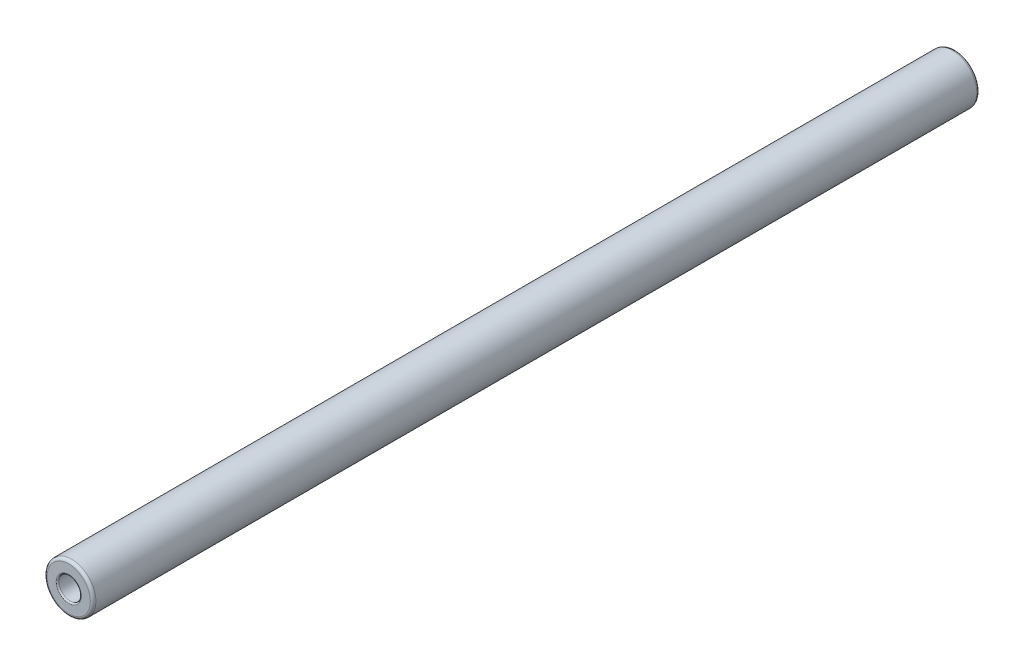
from build123d import *

# Parameters (mm, degrees)
SCHIZZO1_R               = 17.5
RACCORDO1_R              = 2
SCHIZZO5_R               = 8
TAGLIO_ESTRUSIONE3_DEPTH = 75
TAGLIO_ESTRUSIONE4_START = -75
SCHIZZO6_R               = 8
TAGLIO_ESTRUSIONE4_DEPTH = 75
RACCORDO2_R              = 1


with BuildPart() as part:
    # Sweep1: sweep along a path in Schizzo2
    with BuildLine(Plane(origin=(0, 0, 0), x_dir=(0, 0, -1), z_dir=(1, 0, 0))) as sweep1_path:
        Line((0, 0), (636, 0))
    # Schizzo1 → Sweep1 (sweep)
    with BuildSketch(Plane.XY):
        Circle(SCHIZZO1_R)
    sweep(path=sweep1_path.line)

    # Raccordo1
    raccordo1_edges = [part.edges().sort_by_distance(p)[0] for p in [
        (-17.5, 0, 0),
        (-17.5, 0, -636),
    ]]
    fillet(raccordo1_edges, radius=RACCORDO1_R)

    # Schizzo5 → Taglio-Estrusione3 (cut)
    with BuildSketch(Plane(origin=(0, 0, -636), x_dir=(-1, 0, 0), z_dir=(0, 0, -1))):
        Circle(SCHIZZO5_R)
    extrude(amount=-TAGLIO_ESTRUSIONE3_DEPTH, mode=Mode.SUBTRACT)

    # Schizzo6 → Taglio-Estrusione4 (cut)
    with BuildSketch(Plane.XY.offset(TAGLIO_ESTRUSIONE4_START)):
        with Locations(Location((0, 0, 0), (0, 0, 180))):
            Circle(SCHIZZO6_R)
    extrude(amount=TAGLIO_ESTRUSIONE4_DEPTH, mode=Mode.SUBTRACT)

    # Raccordo2
    raccordo2_edges = [part.edges().sort_by_distance(p)[0] for p in [
        (8, 0, -636),
        (8, 0, 0),
    ]]
    fillet(raccordo2_edges, radius=RACCORDO2_R)


solid = part.part
